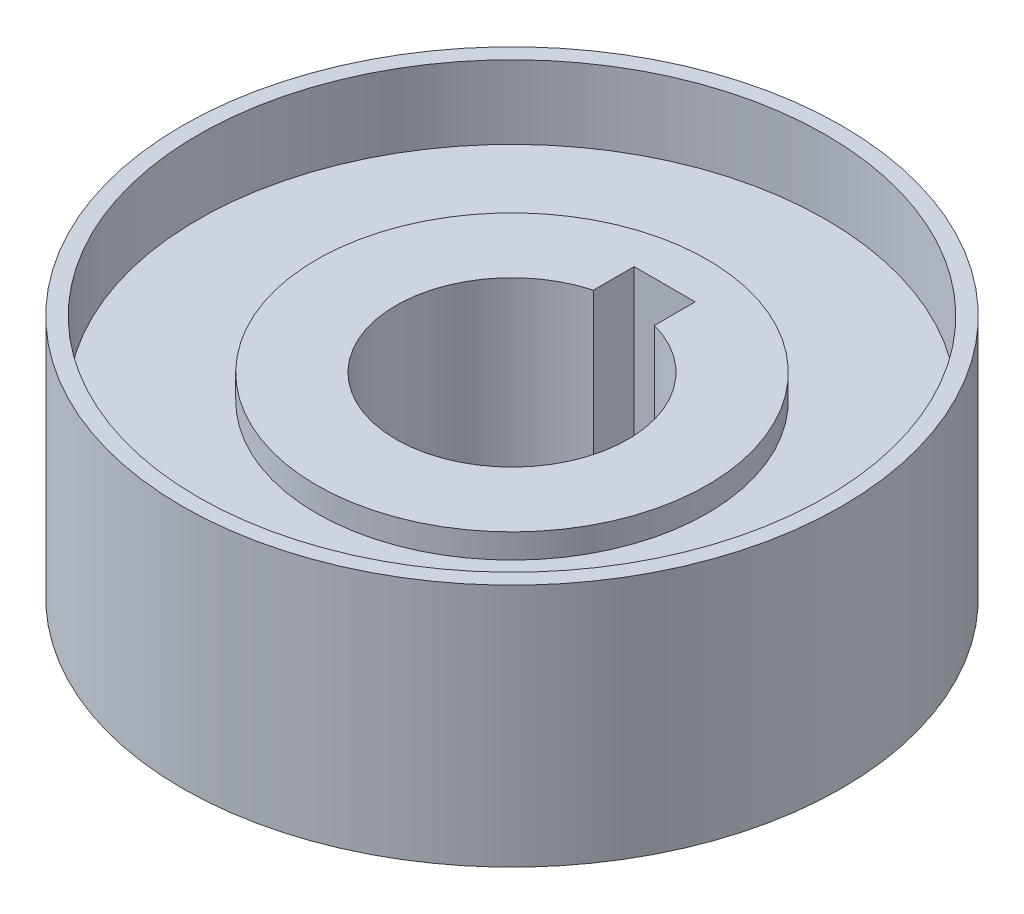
from build123d import *

# Parameters (mm, degrees)
SKETCH1_R      = 13.5
EXTRUDE1_DEPTH = 10
SKETCH2_R      = 12.85
SKETCH2_R_2    = 8
EXTRUDE2_DEPTH = 3
SKETCH4_R      = 8
EXTRUDE3_DEPTH = 2
EXTRUDE4_DEPTH = 21.700241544


with BuildPart() as part:
    # Sketch1 → Extrude1 (new body)
    with BuildSketch(Plane(origin=(0, 0, 0), x_dir=(1, 0, 0), z_dir=(0, 1, 0))):
        with Locations(Location((0, 0, 0), (0, 0, 270))):
            Circle(SKETCH1_R)
    extrude(amount=EXTRUDE1_DEPTH)

    # Sketch2 → Extrude2 (cut)
    with BuildSketch(Plane(origin=(0, 10, 0), x_dir=(1, 0, 0), z_dir=(0, 1, 0))):
        with Locations(Location((0, 0, 0), (0, 0, 270))):
            Circle(SKETCH2_R)
        with Locations(Location((0, 0, 0), (0, 0, 270))):
            Circle(SKETCH2_R_2, mode=Mode.SUBTRACT)
    extrude(amount=-EXTRUDE2_DEPTH, mode=Mode.SUBTRACT)

    # Sketch4 → Extrude3 (cut)
    with BuildSketch(Plane(origin=(0, 10, 0), x_dir=(1, 0, 0), z_dir=(0, 1, 0))):
        with Locations(Location((0, 0, 0), (0, 0, 270))):
            Circle(SKETCH4_R)
    extrude(amount=-EXTRUDE3_DEPTH, mode=Mode.SUBTRACT)

    # Sketch5 → Extrude4 (cut, through all)
    with BuildSketch(Plane(origin=(0, 8, 0), x_dir=(1, 0, 0), z_dir=(0, 1, 0))):
        with BuildLine():
            Line((-1.25, 4.582575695), (-1.25, 6.25))
            Line((-1.25, 6.25), (1.25, 6.25))
            Line((1.25, 6.25), (1.25, 4.582575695))
            ThreePointArc((1.25, 4.582575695), (0, -4.75), (-1.25, 4.582575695))
        make_face()
    extrude(amount=-EXTRUDE4_DEPTH, mode=Mode.SUBTRACT)


solid = part.part
